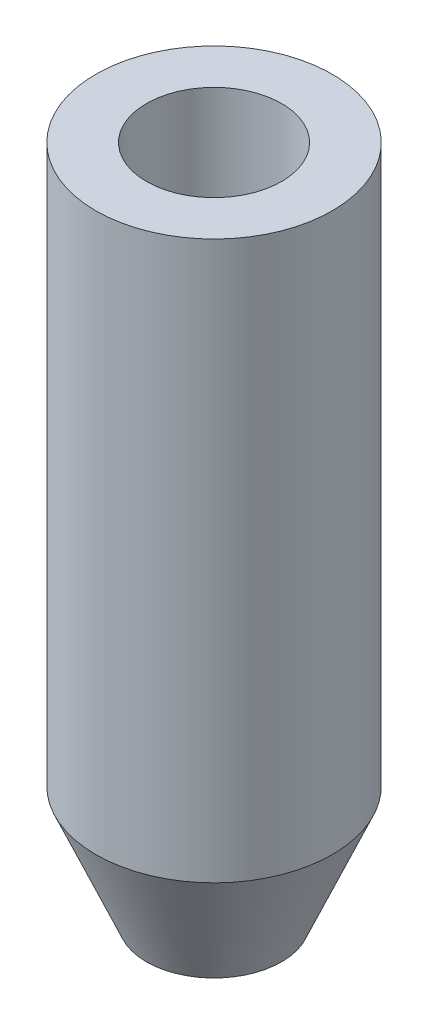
ISO-10303-21;
HEADER;
FILE_DESCRIPTION(('STEP AP214'),'2;1');
FILE_NAME('part.step','',(''),(''),'','','');
FILE_SCHEMA(('AUTOMOTIVE_DESIGN { 1 0 10303 214 1 1 1 1 }'));
ENDSEC;
DATA;
#1=APPLICATION_CONTEXT('core data for automotive mechanical design processes');
#2=APPLICATION_PROTOCOL_DEFINITION('international standard','automotive_design',2000,#1);
#3=PRODUCT_CONTEXT('',#1,'mechanical');
#4=PRODUCT('Part','Part','',(#3));
#5=PRODUCT_RELATED_PRODUCT_CATEGORY('part','',(#4));
#6=PRODUCT_DEFINITION_FORMATION('','',#4);
#7=PRODUCT_DEFINITION_CONTEXT('part definition',#1,'design');
#8=PRODUCT_DEFINITION('design','',#6,#7);
#9=PRODUCT_DEFINITION_SHAPE('','',#8);
#10=(LENGTH_UNIT() NAMED_UNIT(*) SI_UNIT(.MILLI.,.METRE.));
#11=(NAMED_UNIT(*) PLANE_ANGLE_UNIT() SI_UNIT($,.RADIAN.));
#12=(NAMED_UNIT(*) SI_UNIT($,.STERADIAN.) SOLID_ANGLE_UNIT());
#13=UNCERTAINTY_MEASURE_WITH_UNIT(LENGTH_MEASURE(1.E-05),#10,'distance_accuracy_value','');
#14=(GEOMETRIC_REPRESENTATION_CONTEXT(3) GLOBAL_UNCERTAINTY_ASSIGNED_CONTEXT((#13)) GLOBAL_UNIT_ASSIGNED_CONTEXT((#10,
#11,#12)) REPRESENTATION_CONTEXT('',''));
#15=CARTESIAN_POINT('',(0.,0.,0.));
#16=DIRECTION('',(0.,0.,1.));
#17=DIRECTION('',(1.,0.,0.));
#18=AXIS2_PLACEMENT_3D('',#15,#16,#17);
#19=CARTESIAN_POINT('',(0.,10.,0.));
#20=DIRECTION('',(0.,-1.,0.));
#21=DIRECTION('',(0.,0.,-1.));
#22=AXIS2_PLACEMENT_3D('',#19,#20,#21);
#23=CYLINDRICAL_SURFACE('',#22,0.875);
#24=CARTESIAN_POINT('',(0.,-6.5,0.));
#25=DIRECTION('',(0.,-1.,0.));
#26=DIRECTION('',(0.,0.,-1.));
#27=AXIS2_PLACEMENT_3D('',#24,#25,#26);
#28=CIRCLE('',#27,0.875);
#29=CARTESIAN_POINT('',(0.,-6.5,-0.875));
#30=VERTEX_POINT('',#29);
#31=EDGE_CURVE('E50',#30,#30,#28,.F.);
#32=ORIENTED_EDGE('',*,*,#31,.F.);
#33=EDGE_LOOP('',(#32));
#34=FACE_BOUND('',#33,.T.);
#35=CARTESIAN_POINT('',(0.,5.,0.));
#36=DIRECTION('',(0.,1.,0.));
#37=DIRECTION('',(0.,0.,1.));
#38=AXIS2_PLACEMENT_3D('',#35,#36,#37);
#39=CIRCLE('',#38,0.875);
#40=CARTESIAN_POINT('',(0.,5.,0.875));
#41=VERTEX_POINT('',#40);
#42=EDGE_CURVE('E38',#41,#41,#39,.F.);
#43=ORIENTED_EDGE('',*,*,#42,.F.);
#44=EDGE_LOOP('',(#43));
#45=FACE_BOUND('',#44,.T.);
#46=ADVANCED_FACE('F33',(#34,#45),#23,.F.);
#47=CARTESIAN_POINT('',(0.,10.,0.));
#48=DIRECTION('',(0.,-1.,0.));
#49=DIRECTION('',(0.,0.,-1.));
#50=AXIS2_PLACEMENT_3D('',#47,#48,#49);
#51=CYLINDRICAL_SURFACE('',#50,3.5);
#52=CARTESIAN_POINT('',(0.,-6.49999999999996,0.));
#53=DIRECTION('',(0.,1.,0.));
#54=DIRECTION('',(0.,0.,1.));
#55=AXIS2_PLACEMENT_3D('',#52,#53,#54);
#56=CIRCLE('',#55,3.5);
#57=CARTESIAN_POINT('',(0.,-6.49999999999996,3.5));
#58=VERTEX_POINT('',#57);
#59=EDGE_CURVE('E42',#58,#58,#56,.T.);
#60=ORIENTED_EDGE('',*,*,#59,.T.);
#61=EDGE_LOOP('',(#60));
#62=FACE_BOUND('',#61,.T.);
#63=CARTESIAN_POINT('',(0.,10.,0.));
#64=DIRECTION('',(0.,1.,0.));
#65=DIRECTION('',(0.,0.,1.));
#66=AXIS2_PLACEMENT_3D('',#63,#64,#65);
#67=CIRCLE('',#66,3.5);
#68=CARTESIAN_POINT('',(0.,10.,3.5));
#69=VERTEX_POINT('',#68);
#70=EDGE_CURVE('E47',#69,#69,#67,.T.);
#71=ORIENTED_EDGE('',*,*,#70,.F.);
#72=EDGE_LOOP('',(#71));
#73=FACE_BOUND('',#72,.T.);
#74=ADVANCED_FACE('F77',(#62,#73),#51,.T.);
#75=CARTESIAN_POINT('',(0.,10.,0.));
#76=DIRECTION('',(0.,1.,0.));
#77=DIRECTION('',(0.,0.,1.));
#78=AXIS2_PLACEMENT_3D('',#75,#76,#77);
#79=PLANE('',#78);
#80=CARTESIAN_POINT('',(0.,10.,0.));
#81=DIRECTION('',(0.,1.,0.));
#82=DIRECTION('',(0.,0.,1.));
#83=AXIS2_PLACEMENT_3D('',#80,#81,#82);
#84=CIRCLE('',#83,2.);
#85=CARTESIAN_POINT('',(0.,10.,2.));
#86=VERTEX_POINT('',#85);
#87=EDGE_CURVE('E64',#86,#86,#84,.T.);
#88=ORIENTED_EDGE('',*,*,#87,.F.);
#89=EDGE_LOOP('',(#88));
#90=FACE_BOUND('',#89,.T.);
#91=ORIENTED_EDGE('',*,*,#70,.T.);
#92=EDGE_LOOP('',(#91));
#93=FACE_BOUND('',#92,.T.);
#94=ADVANCED_FACE('F83',(#90,#93),#79,.T.);
#95=CARTESIAN_POINT('',(0.,-10.,0.));
#96=DIRECTION('',(0.,1.,0.));
#97=DIRECTION('',(0.,0.,1.));
#98=AXIS2_PLACEMENT_3D('',#95,#96,#97);
#99=PLANE('',#98);
#100=CARTESIAN_POINT('',(0.,-10.,0.));
#101=DIRECTION('',(0.,-1.,0.));
#102=DIRECTION('',(0.,0.,-1.));
#103=AXIS2_PLACEMENT_3D('',#100,#101,#102);
#104=CIRCLE('',#103,1.35);
#105=CARTESIAN_POINT('',(0.,-10.,-1.35));
#106=VERTEX_POINT('',#105);
#107=EDGE_CURVE('E57',#106,#106,#104,.T.);
#108=ORIENTED_EDGE('',*,*,#107,.F.);
#109=EDGE_LOOP('',(#108));
#110=FACE_BOUND('',#109,.T.);
#111=CARTESIAN_POINT('',(0.,-10.,0.));
#112=DIRECTION('',(0.,1.,0.));
#113=DIRECTION('',(0.,0.,1.));
#114=AXIS2_PLACEMENT_3D('',#111,#112,#113);
#115=CIRCLE('',#114,1.99999999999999);
#116=CARTESIAN_POINT('',(0.,-10.,1.99999999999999));
#117=VERTEX_POINT('',#116);
#118=EDGE_CURVE('E10',#117,#117,#115,.F.);
#119=ORIENTED_EDGE('',*,*,#118,.T.);
#120=EDGE_LOOP('',(#119));
#121=FACE_BOUND('',#120,.T.);
#122=ADVANCED_FACE('F91',(#110,#121),#99,.F.);
#123=CARTESIAN_POINT('',(0.,-6.49999999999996,0.));
#124=DIRECTION('',(0.,1.,0.));
#125=DIRECTION('',(0.,0.,1.));
#126=AXIS2_PLACEMENT_3D('',#123,#124,#125);
#127=CONICAL_SURFACE('',#126,3.5,0.404891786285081);
#128=ORIENTED_EDGE('',*,*,#118,.F.);
#129=EDGE_LOOP('',(#128));
#130=FACE_BOUND('',#129,.T.);
#131=ORIENTED_EDGE('',*,*,#59,.F.);
#132=EDGE_LOOP('',(#131));
#133=FACE_BOUND('',#132,.T.);
#134=ADVANCED_FACE('F36',(#130,#133),#127,.T.);
#135=CARTESIAN_POINT('',(0.,-6.5,0.));
#136=DIRECTION('',(0.,-1.,0.));
#137=DIRECTION('',(0.,0.,-1.));
#138=AXIS2_PLACEMENT_3D('',#135,#136,#137);
#139=PLANE('',#138);
#140=CARTESIAN_POINT('',(0.,-6.5,0.));
#141=DIRECTION('',(0.,-1.,0.));
#142=DIRECTION('',(0.,0.,-1.));
#143=AXIS2_PLACEMENT_3D('',#140,#141,#142);
#144=CIRCLE('',#143,1.35);
#145=CARTESIAN_POINT('',(0.,-6.5,-1.35));
#146=VERTEX_POINT('',#145);
#147=EDGE_CURVE('E52',#146,#146,#144,.T.);
#148=ORIENTED_EDGE('',*,*,#147,.T.);
#149=EDGE_LOOP('',(#148));
#150=FACE_BOUND('',#149,.T.);
#151=ORIENTED_EDGE('',*,*,#31,.T.);
#152=EDGE_LOOP('',(#151));
#153=FACE_BOUND('',#152,.T.);
#154=ADVANCED_FACE('F98',(#150,#153),#139,.T.);
#155=CARTESIAN_POINT('',(0.,-6.5,0.));
#156=DIRECTION('',(0.,-1.,0.));
#157=DIRECTION('',(0.,0.,-1.));
#158=AXIS2_PLACEMENT_3D('',#155,#156,#157);
#159=CYLINDRICAL_SURFACE('',#158,1.35);
#160=ORIENTED_EDGE('',*,*,#147,.F.);
#161=EDGE_LOOP('',(#160));
#162=FACE_BOUND('',#161,.T.);
#163=ORIENTED_EDGE('',*,*,#107,.T.);
#164=EDGE_LOOP('',(#163));
#165=FACE_BOUND('',#164,.T.);
#166=ADVANCED_FACE('F87',(#162,#165),#159,.F.);
#167=CARTESIAN_POINT('',(0.,5.,0.));
#168=DIRECTION('',(0.,1.,0.));
#169=DIRECTION('',(0.,0.,1.));
#170=AXIS2_PLACEMENT_3D('',#167,#168,#169);
#171=PLANE('',#170);
#172=CARTESIAN_POINT('',(0.,5.,0.));
#173=DIRECTION('',(0.,1.,0.));
#174=DIRECTION('',(0.,0.,1.));
#175=AXIS2_PLACEMENT_3D('',#172,#173,#174);
#176=CIRCLE('',#175,2.);
#177=CARTESIAN_POINT('',(0.,5.,2.));
#178=VERTEX_POINT('',#177);
#179=EDGE_CURVE('E67',#178,#178,#176,.T.);
#180=ORIENTED_EDGE('',*,*,#179,.T.);
#181=EDGE_LOOP('',(#180));
#182=FACE_BOUND('',#181,.T.);
#183=ORIENTED_EDGE('',*,*,#42,.T.);
#184=EDGE_LOOP('',(#183));
#185=FACE_BOUND('',#184,.T.);
#186=ADVANCED_FACE('F74',(#182,#185),#171,.T.);
#187=CARTESIAN_POINT('',(0.,5.,0.));
#188=DIRECTION('',(0.,1.,0.));
#189=DIRECTION('',(0.,0.,1.));
#190=AXIS2_PLACEMENT_3D('',#187,#188,#189);
#191=CYLINDRICAL_SURFACE('',#190,2.);
#192=ORIENTED_EDGE('',*,*,#179,.F.);
#193=EDGE_LOOP('',(#192));
#194=FACE_BOUND('',#193,.T.);
#195=ORIENTED_EDGE('',*,*,#87,.T.);
#196=EDGE_LOOP('',(#195));
#197=FACE_BOUND('',#196,.T.);
#198=ADVANCED_FACE('F108',(#194,#197),#191,.F.);
#199=CLOSED_SHELL('',(#46,#74,#94,#122,#134,#154,#166,#186,#198));
#200=MANIFOLD_SOLID_BREP('B2',#199);
#201=ADVANCED_BREP_SHAPE_REPRESENTATION('',(#18,#200),#14);
#202=SHAPE_DEFINITION_REPRESENTATION(#9,#201);
ENDSEC;
END-ISO-10303-21;
